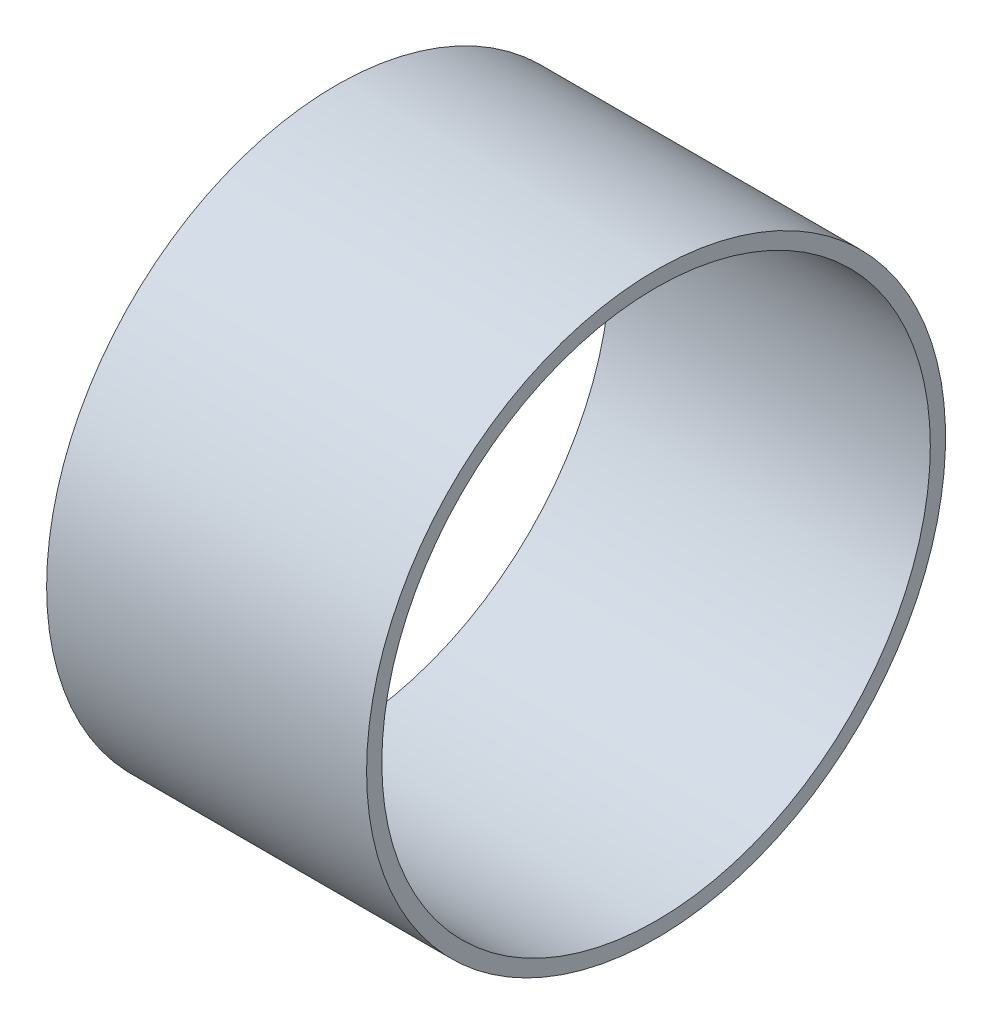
ISO-10303-21;
HEADER;
FILE_DESCRIPTION(('STEP AP214'),'2;1');
FILE_NAME('part.step','',(''),(''),'','','');
FILE_SCHEMA(('AUTOMOTIVE_DESIGN { 1 0 10303 214 1 1 1 1 }'));
ENDSEC;
DATA;
#1=APPLICATION_CONTEXT('core data for automotive mechanical design processes');
#2=APPLICATION_PROTOCOL_DEFINITION('international standard','automotive_design',2000,#1);
#3=PRODUCT_CONTEXT('',#1,'mechanical');
#4=PRODUCT('Part','Part','',(#3));
#5=PRODUCT_RELATED_PRODUCT_CATEGORY('part','',(#4));
#6=PRODUCT_DEFINITION_FORMATION('','',#4);
#7=PRODUCT_DEFINITION_CONTEXT('part definition',#1,'design');
#8=PRODUCT_DEFINITION('design','',#6,#7);
#9=PRODUCT_DEFINITION_SHAPE('','',#8);
#10=(LENGTH_UNIT() NAMED_UNIT(*) SI_UNIT(.MILLI.,.METRE.));
#11=(NAMED_UNIT(*) PLANE_ANGLE_UNIT() SI_UNIT($,.RADIAN.));
#12=(NAMED_UNIT(*) SI_UNIT($,.STERADIAN.) SOLID_ANGLE_UNIT());
#13=UNCERTAINTY_MEASURE_WITH_UNIT(LENGTH_MEASURE(1.E-05),#10,'distance_accuracy_value','');
#14=(GEOMETRIC_REPRESENTATION_CONTEXT(3) GLOBAL_UNCERTAINTY_ASSIGNED_CONTEXT((#13)) GLOBAL_UNIT_ASSIGNED_CONTEXT((#10,
#11,#12)) REPRESENTATION_CONTEXT('',''));
#15=CARTESIAN_POINT('',(0.,0.,0.));
#16=DIRECTION('',(0.,0.,1.));
#17=DIRECTION('',(1.,0.,0.));
#18=AXIS2_PLACEMENT_3D('',#15,#16,#17);
#19=CARTESIAN_POINT('',(42.,0.,0.));
#20=DIRECTION('',(-1.,0.,0.));
#21=DIRECTION('',(0.,0.,1.));
#22=AXIS2_PLACEMENT_3D('',#19,#20,#21);
#23=CYLINDRICAL_SURFACE('',#22,38.);
#24=CARTESIAN_POINT('',(42.,0.,0.));
#25=DIRECTION('',(-1.,0.,0.));
#26=DIRECTION('',(0.,0.,1.));
#27=AXIS2_PLACEMENT_3D('',#24,#25,#26);
#28=CIRCLE('',#27,38.);
#29=CARTESIAN_POINT('',(42.,0.,38.));
#30=VERTEX_POINT('',#29);
#31=EDGE_CURVE('E10',#30,#30,#28,.T.);
#32=ORIENTED_EDGE('',*,*,#31,.T.);
#33=EDGE_LOOP('',(#32));
#34=FACE_BOUND('',#33,.T.);
#35=CARTESIAN_POINT('',(0.,0.,0.));
#36=DIRECTION('',(-1.,0.,0.));
#37=DIRECTION('',(0.,0.,1.));
#38=AXIS2_PLACEMENT_3D('',#35,#36,#37);
#39=CIRCLE('',#38,38.);
#40=CARTESIAN_POINT('',(0.,0.,38.));
#41=VERTEX_POINT('',#40);
#42=EDGE_CURVE('E47',#41,#41,#39,.T.);
#43=ORIENTED_EDGE('',*,*,#42,.F.);
#44=EDGE_LOOP('',(#43));
#45=FACE_BOUND('',#44,.T.);
#46=ADVANCED_FACE('F33',(#34,#45),#23,.T.);
#47=CARTESIAN_POINT('',(42.,38.,0.));
#48=DIRECTION('',(1.,0.,0.));
#49=DIRECTION('',(0.,0.,-1.));
#50=AXIS2_PLACEMENT_3D('',#47,#48,#49);
#51=PLANE('',#50);
#52=CARTESIAN_POINT('',(42.,0.,0.));
#53=DIRECTION('',(-1.,0.,0.));
#54=DIRECTION('',(0.,0.,1.));
#55=AXIS2_PLACEMENT_3D('',#52,#53,#54);
#56=CIRCLE('',#55,36.);
#57=CARTESIAN_POINT('',(42.,0.,36.));
#58=VERTEX_POINT('',#57);
#59=EDGE_CURVE('E39',#58,#58,#56,.T.);
#60=ORIENTED_EDGE('',*,*,#59,.T.);
#61=EDGE_LOOP('',(#60));
#62=FACE_BOUND('',#61,.T.);
#63=ORIENTED_EDGE('',*,*,#31,.F.);
#64=EDGE_LOOP('',(#63));
#65=FACE_BOUND('',#64,.T.);
#66=ADVANCED_FACE('F57',(#62,#65),#51,.T.);
#67=CARTESIAN_POINT('',(42.,0.,0.));
#68=DIRECTION('',(-1.,0.,0.));
#69=DIRECTION('',(0.,0.,1.));
#70=AXIS2_PLACEMENT_3D('',#67,#68,#69);
#71=CYLINDRICAL_SURFACE('',#70,36.);
#72=CARTESIAN_POINT('',(0.,0.,0.));
#73=DIRECTION('',(-1.,0.,0.));
#74=DIRECTION('',(0.,0.,1.));
#75=AXIS2_PLACEMENT_3D('',#72,#73,#74);
#76=CIRCLE('',#75,36.);
#77=CARTESIAN_POINT('',(0.,0.,36.));
#78=VERTEX_POINT('',#77);
#79=EDGE_CURVE('E43',#78,#78,#76,.T.);
#80=ORIENTED_EDGE('',*,*,#79,.T.);
#81=EDGE_LOOP('',(#80));
#82=FACE_BOUND('',#81,.T.);
#83=ORIENTED_EDGE('',*,*,#59,.F.);
#84=EDGE_LOOP('',(#83));
#85=FACE_BOUND('',#84,.T.);
#86=ADVANCED_FACE('F61',(#82,#85),#71,.F.);
#87=CARTESIAN_POINT('',(0.,36.,0.));
#88=DIRECTION('',(-1.,0.,0.));
#89=DIRECTION('',(0.,0.,1.));
#90=AXIS2_PLACEMENT_3D('',#87,#88,#89);
#91=PLANE('',#90);
#92=ORIENTED_EDGE('',*,*,#42,.T.);
#93=EDGE_LOOP('',(#92));
#94=FACE_BOUND('',#93,.T.);
#95=ORIENTED_EDGE('',*,*,#79,.F.);
#96=EDGE_LOOP('',(#95));
#97=FACE_BOUND('',#96,.T.);
#98=ADVANCED_FACE('F53',(#94,#97),#91,.T.);
#99=CLOSED_SHELL('',(#46,#66,#86,#98));
#100=MANIFOLD_SOLID_BREP('B2',#99);
#101=ADVANCED_BREP_SHAPE_REPRESENTATION('',(#18,#100),#14);
#102=SHAPE_DEFINITION_REPRESENTATION(#9,#101);
ENDSEC;
END-ISO-10303-21;
